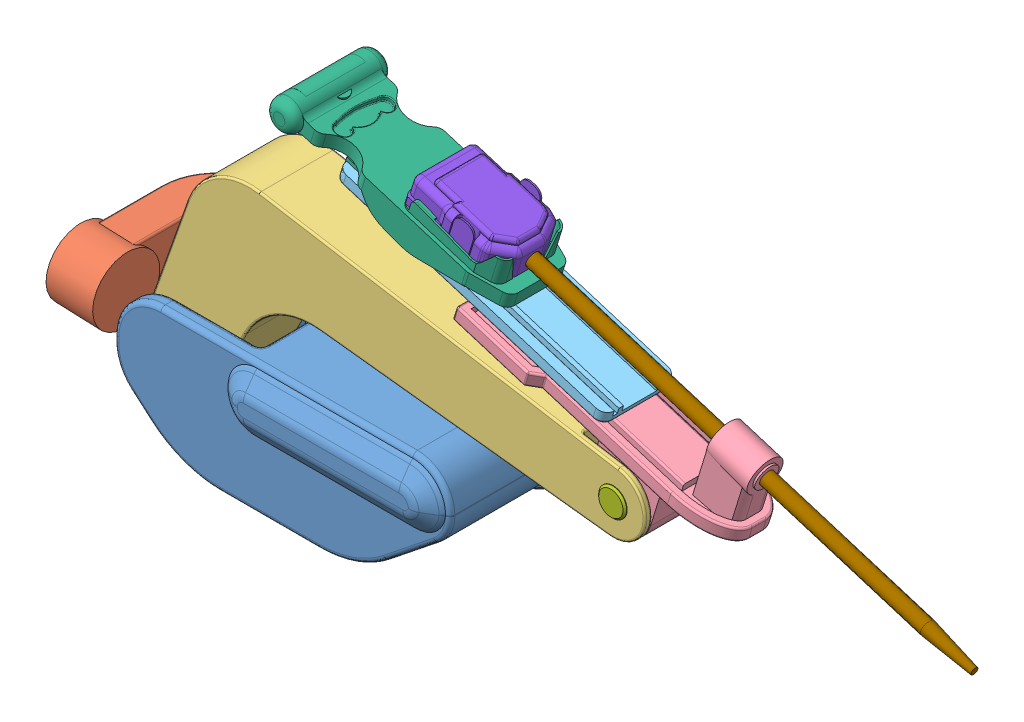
SolidWorks assembly Assembly 2.SLDASM, configuration Varsayılan (file format 10000). Lengths in mm.
Overall size (938.47 412.53 182.12).
9 component instances, 9 part files, 17 mates.
Components (placement in the parent):
- 19-1: 19.SLDPRT [Varsayılan] at (-2.307 -80.4709 -104.4246) size (365.79 145.79 142.85)
- 20-1: 20.SLDPRT [Varsayılan] at (94.8952 -13.0422 -105.4246) x (0.999236 -0.039071 0) z (0.039071 0.999236 0) size (428 178.6 72)
- 21-1: 21.SLDPRT [Varsayılan] at (164.9241 125.1775 -84.4246) x (0.993661 -0.112417 0) z (0 0 1) size (525.28 238.03 80)
- 22-1: 22.SLDPRT [Varsayılan] at (352.1969 101.455 -76.9246) x (0.955617 -0.294612 0) z (0 0 1) size (297.2 151.17 95)
- 23-1: 23.SLDPRT [Varsayılan] at (281.8873 170.2211 -76.9246) x (0.955617 -0.294612 0) z (0.294612 0.955617 0) size (300 77 22)
- 25-1: 25.SLDPRT [Varsayılan] at (163.3654 223.5039 -76.9246) x (0.955617 -0.294612 0) z (0.294612 0.955617 0) size (251.21 106 58.94)
- 24-2: 24.SLDPRT [Varsayılan] at (352.1969 101.455 -86.9246) size (30 30 85)
- 26-1: 26.SLDPRT [Varsayılan] at (173.6768 256.9505 -76.9246) x (0.955617 -0.294612 0) z (0.294612 0.955617 0) size (105.21 73 33)
- 27-1: 27.SLDPRT [Varsayılan] at (221.2825 244.9528 -44.4246) x (0.955617 -0.294612 0) z (0.257506 0.835258 0.485834) size (500 15 15)
Mates (geometry in assembly coordinates):
- Çakışık1: coincident aligned: axis of 19-1 through (157.693 19.5291 -105.4246) axis (0 0 -1); axis of 20-1 through (157.693 19.5291 -105.4246) axis (0 0 -1)
- Çakışık2: coincident anti-aligned: plane of 19-1 through (157.693 19.5291 -105.4246) normal (0 0 -1); plane of 20-1 through (157.693 19.5291 -105.4246) normal (0 0 1)
- Çakışık3: coincident aligned: axis of 19-1 through (-112.307 9.5291 -79.4246) axis (0 0 -1); axis of 21-1 through (-112.307 9.5291 -9.4246) axis (0 0 -1)
- Genişlik1: width aligned: plane of 21-1 through (164.9241 125.1775 -4.4246) normal (0 0 1); plane of 21-1 through (164.9241 125.1775 -84.4246) normal (0 0 -1); plane of 19-1 through (-2.307 -80.4709 -99.4246) normal (0 0 1); plane of 19-1 through (-2.307 -80.4709 10.5754) normal (0 0 -1)
- Çakışık4: coincident anti-aligned: axis of 21-1 through (352.1969 101.455 -11.9246) axis (0 0 1); axis of 22-1 through (352.1969 101.455 -11.9246) axis (0 0 -1)
- Genişlik2: width aligned: plane of 22-1 through (352.1969 101.455 -11.9246) normal (0 0 1); plane of 22-1 through (352.1969 101.455 -76.9246) normal (0 0 -1); plane of 21-1 through (452.7239 10.7703 -76.9246) normal (0 0 1); plane of 21-1 through (452.7239 10.7703 -11.9246) normal (0 0 -1)
- Çakışık5: coincident anti-aligned: plane of 22-1 through (365.4545 144.4578 -14.9246) normal (0 0 -1); plane of 23-1 through (191.8465 208.4446 -14.9246) normal (0 0 1)
- Çakışık6: coincident anti-aligned: plane of 22-1 through (365.4545 144.4578 -76.9246) normal (0.294612 0.955617 0); plane of 23-1 through (354.0619 147.9701 -67.9246) normal (-0.294612 -0.955617 0)
- Çakışık7: coincident anti-aligned: plane of 23-1 through (286.6011 185.5109 -15.9246) normal (0 0 -1); plane of 25-1 through (55.4343 267.2429 -15.9246) normal (0 0 1)
- Çakışık8: coincident anti-aligned: plane of 23-1 through (286.6011 185.5109 -76.9246) normal (0.294612 0.955617 0); plane of 25-1 through (163.3654 223.5039 -76.9246) normal (-0.294612 -0.955617 0)
- Çakışık9: coincident aligned: axis of 22-1 through (352.1969 101.455 -11.9246) axis (0 0 -1); axis of 24-2 through (352.1969 101.455 -3.9246) axis (0 0 -1)
- Genişlik3: width anti-aligned: plane of 24-2 through (352.1969 101.455 -86.9246) normal (0 0 -1); plane of 24-2 through (352.1969 101.455 -1.9246) normal (0 0 1); plane of 21-1 through (164.9241 125.1775 -4.4246) normal (0 0 1); plane of 21-1 through (164.9241 125.1775 -84.4246) normal (0 0 -1)
- Çakışık10: coincident anti-aligned: plane of 25-1 through (171.3199 249.3055 -76.9246) normal (0.294612 0.955617 0); plane of 26-1 through (131.9626 261.4392 -15.9246) normal (-0.294612 -0.955617 0)
- Çakışık11: coincident anti-aligned: plane of 25-1 through (139.3279 285.3296 -7.9246) normal (0 0 -1); plane of 26-1 through (131.9626 261.4392 -7.9246) normal (0 0 1)
- Çakışık12: coincident aligned: plane of 25-1 through (122.4064 264.3853 -76.9246) normal (-0.955617 0.294612 0); plane of 26-1 through (122.4064 264.3853 -72.9246) normal (-0.955617 0.294612 0)
- Çakışık13: coincident anti-aligned: axis of 22-1 through (431.3464 180.1912 -44.4246) axis (0.955617 -0.294612 0); axis of 27-1 through (648.9275 113.1121 -44.4246) axis (-0.955617 0.294612 0)
- Çakışık14: coincident anti-aligned: plane of 26-1 through (221.2816 244.9498 -44.4246) normal (0.955617 -0.294612 0); plane of 27-1 through (221.2825 244.9528 -44.4246) normal (-0.955617 0.294612 0)
